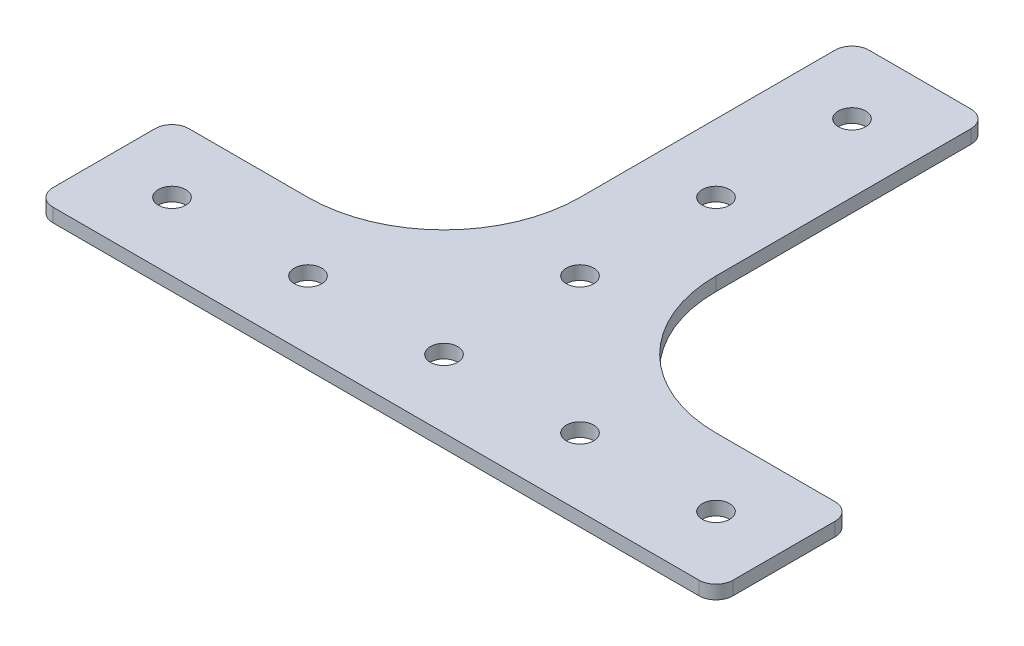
ISO-10303-21;
HEADER;
FILE_DESCRIPTION(('STEP AP214'),'2;1');
FILE_NAME('part.step','',(''),(''),'','','');
FILE_SCHEMA(('AUTOMOTIVE_DESIGN { 1 0 10303 214 1 1 1 1 }'));
ENDSEC;
DATA;
#1=APPLICATION_CONTEXT('core data for automotive mechanical design processes');
#2=APPLICATION_PROTOCOL_DEFINITION('international standard','automotive_design',2000,#1);
#3=PRODUCT_CONTEXT('',#1,'mechanical');
#4=PRODUCT('Part','Part','',(#3));
#5=PRODUCT_RELATED_PRODUCT_CATEGORY('part','',(#4));
#6=PRODUCT_DEFINITION_FORMATION('','',#4);
#7=PRODUCT_DEFINITION_CONTEXT('part definition',#1,'design');
#8=PRODUCT_DEFINITION('design','',#6,#7);
#9=PRODUCT_DEFINITION_SHAPE('','',#8);
#10=(LENGTH_UNIT() NAMED_UNIT(*) SI_UNIT(.MILLI.,.METRE.));
#11=(NAMED_UNIT(*) PLANE_ANGLE_UNIT() SI_UNIT($,.RADIAN.));
#12=(NAMED_UNIT(*) SI_UNIT($,.STERADIAN.) SOLID_ANGLE_UNIT());
#13=UNCERTAINTY_MEASURE_WITH_UNIT(LENGTH_MEASURE(1.E-05),#10,'distance_accuracy_value','');
#14=(GEOMETRIC_REPRESENTATION_CONTEXT(3) GLOBAL_UNCERTAINTY_ASSIGNED_CONTEXT((#13)) GLOBAL_UNIT_ASSIGNED_CONTEXT((#10,
#11,#12)) REPRESENTATION_CONTEXT('',''));
#15=CARTESIAN_POINT('',(0.,0.,0.));
#16=DIRECTION('',(0.,0.,1.));
#17=DIRECTION('',(1.,0.,0.));
#18=AXIS2_PLACEMENT_3D('',#15,#16,#17);
#19=CARTESIAN_POINT('',(-12.7,2.54,-25.4));
#20=DIRECTION('',(1.,0.,0.));
#21=DIRECTION('',(0.,0.,-1.));
#22=AXIS2_PLACEMENT_3D('',#19,#20,#21);
#23=PLANE('',#22);
#24=DIRECTION('',(0.,0.,1.));
#25=VECTOR('',#24,1.);
#26=CARTESIAN_POINT('',(-12.7,0.,-25.4));
#27=LINE('',#26,#25);
#28=CARTESIAN_POINT('',(-12.7,0.,-98.425));
#29=VERTEX_POINT('',#28);
#30=CARTESIAN_POINT('',(-12.7,0.,-50.8));
#31=VERTEX_POINT('',#30);
#32=EDGE_CURVE('E364',#29,#31,#27,.T.);
#33=ORIENTED_EDGE('',*,*,#32,.T.);
#34=DIRECTION('',(0.,-1.,0.));
#35=VECTOR('',#34,1.);
#36=CARTESIAN_POINT('',(-12.7,2.54,-50.8));
#37=LINE('',#36,#35);
#38=CARTESIAN_POINT('',(-12.7,2.54,-50.8));
#39=VERTEX_POINT('',#38);
#40=EDGE_CURVE('E274',#31,#39,#37,.F.);
#41=ORIENTED_EDGE('',*,*,#40,.T.);
#42=DIRECTION('',(0.,0.,1.));
#43=VECTOR('',#42,1.);
#44=CARTESIAN_POINT('',(-12.7,2.54,-25.4));
#45=LINE('',#44,#43);
#46=CARTESIAN_POINT('',(-12.7,2.54,-98.425));
#47=VERTEX_POINT('',#46);
#48=EDGE_CURVE('E197',#47,#39,#45,.T.);
#49=ORIENTED_EDGE('',*,*,#48,.F.);
#50=DIRECTION('',(0.,-1.,0.));
#51=VECTOR('',#50,1.);
#52=CARTESIAN_POINT('',(-12.7,2.54,-98.425));
#53=LINE('',#52,#51);
#54=EDGE_CURVE('E248',#47,#29,#53,.T.);
#55=ORIENTED_EDGE('',*,*,#54,.T.);
#56=EDGE_LOOP('',(#33,#41,#49,#55));
#57=FACE_BOUND('',#56,.T.);
#58=ADVANCED_FACE('F48',(#57),#23,.F.);
#59=CARTESIAN_POINT('',(-63.5,2.54,-25.4));
#60=DIRECTION('',(0.,0.,1.));
#61=DIRECTION('',(1.,0.,0.));
#62=AXIS2_PLACEMENT_3D('',#59,#60,#61);
#63=PLANE('',#62);
#64=DIRECTION('',(-1.,0.,0.));
#65=VECTOR('',#64,1.);
#66=CARTESIAN_POINT('',(-63.5,2.54,-25.4));
#67=LINE('',#66,#65);
#68=CARTESIAN_POINT('',(-38.1,2.54,-25.4));
#69=VERTEX_POINT('',#68);
#70=CARTESIAN_POINT('',(-60.325,2.54,-25.4));
#71=VERTEX_POINT('',#70);
#72=EDGE_CURVE('E347',#69,#71,#67,.T.);
#73=ORIENTED_EDGE('',*,*,#72,.F.);
#74=DIRECTION('',(0.,-1.,0.));
#75=VECTOR('',#74,1.);
#76=CARTESIAN_POINT('',(-38.1,0.,-25.4));
#77=LINE('',#76,#75);
#78=CARTESIAN_POINT('',(-38.1,0.,-25.4));
#79=VERTEX_POINT('',#78);
#80=EDGE_CURVE('E270',#69,#79,#77,.T.);
#81=ORIENTED_EDGE('',*,*,#80,.T.);
#82=DIRECTION('',(-1.,0.,0.));
#83=VECTOR('',#82,1.);
#84=CARTESIAN_POINT('',(-63.5,0.,-25.4));
#85=LINE('',#84,#83);
#86=CARTESIAN_POINT('',(-60.325,0.,-25.4));
#87=VERTEX_POINT('',#86);
#88=EDGE_CURVE('E368',#79,#87,#85,.T.);
#89=ORIENTED_EDGE('',*,*,#88,.T.);
#90=DIRECTION('',(0.,-1.,0.));
#91=VECTOR('',#90,1.);
#92=CARTESIAN_POINT('',(-60.325,2.54,-25.4));
#93=LINE('',#92,#91);
#94=EDGE_CURVE('E244',#87,#71,#93,.F.);
#95=ORIENTED_EDGE('',*,*,#94,.T.);
#96=EDGE_LOOP('',(#73,#81,#89,#95));
#97=FACE_BOUND('',#96,.T.);
#98=ADVANCED_FACE('F402',(#97),#63,.F.);
#99=CARTESIAN_POINT('',(-63.5,2.54,0.));
#100=DIRECTION('',(1.,0.,0.));
#101=DIRECTION('',(0.,0.,-1.));
#102=AXIS2_PLACEMENT_3D('',#99,#100,#101);
#103=PLANE('',#102);
#104=DIRECTION('',(0.,0.,1.));
#105=VECTOR('',#104,1.);
#106=CARTESIAN_POINT('',(-63.5,2.54,0.));
#107=LINE('',#106,#105);
#108=CARTESIAN_POINT('',(-63.5,2.54,-22.225));
#109=VERTEX_POINT('',#108);
#110=CARTESIAN_POINT('',(-63.5,2.54,-3.175));
#111=VERTEX_POINT('',#110);
#112=EDGE_CURVE('E342',#109,#111,#107,.T.);
#113=ORIENTED_EDGE('',*,*,#112,.F.);
#114=DIRECTION('',(0.,-1.,0.));
#115=VECTOR('',#114,1.);
#116=CARTESIAN_POINT('',(-63.5,2.54,-22.225));
#117=LINE('',#116,#115);
#118=CARTESIAN_POINT('',(-63.5,0.,-22.225));
#119=VERTEX_POINT('',#118);
#120=EDGE_CURVE('E240',#109,#119,#117,.T.);
#121=ORIENTED_EDGE('',*,*,#120,.T.);
#122=DIRECTION('',(0.,0.,1.));
#123=VECTOR('',#122,1.);
#124=CARTESIAN_POINT('',(-63.5,0.,0.));
#125=LINE('',#124,#123);
#126=CARTESIAN_POINT('',(-63.5,0.,-3.175));
#127=VERTEX_POINT('',#126);
#128=EDGE_CURVE('E371',#119,#127,#125,.T.);
#129=ORIENTED_EDGE('',*,*,#128,.T.);
#130=DIRECTION('',(0.,-1.,0.));
#131=VECTOR('',#130,1.);
#132=CARTESIAN_POINT('',(-63.5,2.54,-3.175));
#133=LINE('',#132,#131);
#134=EDGE_CURVE('E237',#127,#111,#133,.F.);
#135=ORIENTED_EDGE('',*,*,#134,.T.);
#136=EDGE_LOOP('',(#113,#121,#129,#135));
#137=FACE_BOUND('',#136,.T.);
#138=ADVANCED_FACE('F399',(#137),#103,.F.);
#139=CARTESIAN_POINT('',(-63.5,2.54,0.));
#140=DIRECTION('',(0.,0.,-1.));
#141=DIRECTION('',(-1.,0.,0.));
#142=AXIS2_PLACEMENT_3D('',#139,#140,#141);
#143=PLANE('',#142);
#144=DIRECTION('',(1.,0.,0.));
#145=VECTOR('',#144,1.);
#146=CARTESIAN_POINT('',(-63.5,0.,0.));
#147=LINE('',#146,#145);
#148=CARTESIAN_POINT('',(-60.325,0.,0.));
#149=VERTEX_POINT('',#148);
#150=CARTESIAN_POINT('',(60.325,0.,0.));
#151=VERTEX_POINT('',#150);
#152=EDGE_CURVE('E191',#149,#151,#147,.T.);
#153=ORIENTED_EDGE('',*,*,#152,.T.);
#154=DIRECTION('',(0.,-1.,0.));
#155=VECTOR('',#154,1.);
#156=CARTESIAN_POINT('',(60.325,2.54,0.));
#157=LINE('',#156,#155);
#158=CARTESIAN_POINT('',(60.325,2.54,0.));
#159=VERTEX_POINT('',#158);
#160=EDGE_CURVE('E267',#151,#159,#157,.F.);
#161=ORIENTED_EDGE('',*,*,#160,.T.);
#162=DIRECTION('',(1.,0.,0.));
#163=VECTOR('',#162,1.);
#164=CARTESIAN_POINT('',(-63.5,2.54,0.));
#165=LINE('',#164,#163);
#166=CARTESIAN_POINT('',(-60.325,2.54,0.));
#167=VERTEX_POINT('',#166);
#168=EDGE_CURVE('E337',#167,#159,#165,.T.);
#169=ORIENTED_EDGE('',*,*,#168,.F.);
#170=DIRECTION('',(0.,-1.,0.));
#171=VECTOR('',#170,1.);
#172=CARTESIAN_POINT('',(-60.325,2.54,0.));
#173=LINE('',#172,#171);
#174=EDGE_CURVE('E263',#167,#149,#173,.T.);
#175=ORIENTED_EDGE('',*,*,#174,.T.);
#176=EDGE_LOOP('',(#153,#161,#169,#175));
#177=FACE_BOUND('',#176,.T.);
#178=ADVANCED_FACE('F380',(#177),#143,.F.);
#179=CARTESIAN_POINT('',(63.5,2.54,-25.4));
#180=DIRECTION('',(-1.,0.,0.));
#181=DIRECTION('',(0.,0.,1.));
#182=AXIS2_PLACEMENT_3D('',#179,#180,#181);
#183=PLANE('',#182);
#184=DIRECTION('',(0.,0.,-1.));
#185=VECTOR('',#184,1.);
#186=CARTESIAN_POINT('',(63.5,0.,-25.4));
#187=LINE('',#186,#185);
#188=CARTESIAN_POINT('',(63.5,0.,-3.17500000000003));
#189=VERTEX_POINT('',#188);
#190=CARTESIAN_POINT('',(63.5,0.,-22.225));
#191=VERTEX_POINT('',#190);
#192=EDGE_CURVE('E184',#189,#191,#187,.T.);
#193=ORIENTED_EDGE('',*,*,#192,.T.);
#194=DIRECTION('',(0.,-1.,0.));
#195=VECTOR('',#194,1.);
#196=CARTESIAN_POINT('',(63.5,2.54,-22.225));
#197=LINE('',#196,#195);
#198=CARTESIAN_POINT('',(63.5,2.54,-22.225));
#199=VERTEX_POINT('',#198);
#200=EDGE_CURVE('E167',#191,#199,#197,.F.);
#201=ORIENTED_EDGE('',*,*,#200,.T.);
#202=DIRECTION('',(0.,0.,-1.));
#203=VECTOR('',#202,1.);
#204=CARTESIAN_POINT('',(63.5,2.54,-25.4));
#205=LINE('',#204,#203);
#206=CARTESIAN_POINT('',(63.5,2.54,-3.17500000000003));
#207=VERTEX_POINT('',#206);
#208=EDGE_CURVE('E332',#207,#199,#205,.T.);
#209=ORIENTED_EDGE('',*,*,#208,.F.);
#210=DIRECTION('',(0.,-1.,0.));
#211=VECTOR('',#210,1.);
#212=CARTESIAN_POINT('',(63.5,2.54,-3.17500000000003));
#213=LINE('',#212,#211);
#214=EDGE_CURVE('E171',#207,#189,#213,.T.);
#215=ORIENTED_EDGE('',*,*,#214,.T.);
#216=EDGE_LOOP('',(#193,#201,#209,#215));
#217=FACE_BOUND('',#216,.T.);
#218=ADVANCED_FACE('F390',(#217),#183,.F.);
#219=CARTESIAN_POINT('',(12.7,2.54,-25.4));
#220=DIRECTION('',(0.,0.,1.));
#221=DIRECTION('',(1.,0.,0.));
#222=AXIS2_PLACEMENT_3D('',#219,#220,#221);
#223=PLANE('',#222);
#224=DIRECTION('',(-1.,0.,0.));
#225=VECTOR('',#224,1.);
#226=CARTESIAN_POINT('',(12.7,0.,-25.4));
#227=LINE('',#226,#225);
#228=CARTESIAN_POINT('',(60.325,0.,-25.4));
#229=VERTEX_POINT('',#228);
#230=CARTESIAN_POINT('',(38.1,0.,-25.4));
#231=VERTEX_POINT('',#230);
#232=EDGE_CURVE('E175',#229,#231,#227,.T.);
#233=ORIENTED_EDGE('',*,*,#232,.T.);
#234=DIRECTION('',(0.,-1.,0.));
#235=VECTOR('',#234,1.);
#236=CARTESIAN_POINT('',(38.1,2.54,-25.4));
#237=LINE('',#236,#235);
#238=CARTESIAN_POINT('',(38.1,2.54,-25.4));
#239=VERTEX_POINT('',#238);
#240=EDGE_CURVE('E70',#231,#239,#237,.F.);
#241=ORIENTED_EDGE('',*,*,#240,.T.);
#242=DIRECTION('',(-1.,0.,0.));
#243=VECTOR('',#242,1.);
#244=CARTESIAN_POINT('',(12.7,2.54,-25.4));
#245=LINE('',#244,#243);
#246=CARTESIAN_POINT('',(60.325,2.54,-25.4));
#247=VERTEX_POINT('',#246);
#248=EDGE_CURVE('E176',#247,#239,#245,.T.);
#249=ORIENTED_EDGE('',*,*,#248,.F.);
#250=DIRECTION('',(0.,-1.,0.));
#251=VECTOR('',#250,1.);
#252=CARTESIAN_POINT('',(60.325,2.54,-25.4));
#253=LINE('',#252,#251);
#254=EDGE_CURVE('E166',#247,#229,#253,.T.);
#255=ORIENTED_EDGE('',*,*,#254,.T.);
#256=EDGE_LOOP('',(#233,#241,#249,#255));
#257=FACE_BOUND('',#256,.T.);
#258=ADVANCED_FACE('F174',(#257),#223,.F.);
#259=CARTESIAN_POINT('',(12.7,2.54,-101.6));
#260=DIRECTION('',(-1.,0.,0.));
#261=DIRECTION('',(0.,0.,1.));
#262=AXIS2_PLACEMENT_3D('',#259,#260,#261);
#263=PLANE('',#262);
#264=DIRECTION('',(0.,0.,-1.));
#265=VECTOR('',#264,1.);
#266=CARTESIAN_POINT('',(12.7,2.54,-101.6));
#267=LINE('',#266,#265);
#268=CARTESIAN_POINT('',(12.7,2.54,-50.8));
#269=VERTEX_POINT('',#268);
#270=CARTESIAN_POINT('',(12.7,2.54,-98.425));
#271=VERTEX_POINT('',#270);
#272=EDGE_CURVE('E325',#269,#271,#267,.T.);
#273=ORIENTED_EDGE('',*,*,#272,.F.);
#274=DIRECTION('',(0.,-1.,0.));
#275=VECTOR('',#274,1.);
#276=CARTESIAN_POINT('',(12.7,0.,-50.8));
#277=LINE('',#276,#275);
#278=CARTESIAN_POINT('',(12.7,0.,-50.8));
#279=VERTEX_POINT('',#278);
#280=EDGE_CURVE('E277',#269,#279,#277,.T.);
#281=ORIENTED_EDGE('',*,*,#280,.T.);
#282=DIRECTION('',(0.,0.,-1.));
#283=VECTOR('',#282,1.);
#284=CARTESIAN_POINT('',(12.7,0.,-101.6));
#285=LINE('',#284,#283);
#286=CARTESIAN_POINT('',(12.7,0.,-98.425));
#287=VERTEX_POINT('',#286);
#288=EDGE_CURVE('E183',#279,#287,#285,.T.);
#289=ORIENTED_EDGE('',*,*,#288,.T.);
#290=DIRECTION('',(0.,-1.,0.));
#291=VECTOR('',#290,1.);
#292=CARTESIAN_POINT('',(12.7,2.54,-98.425));
#293=LINE('',#292,#291);
#294=EDGE_CURVE('E259',#287,#271,#293,.F.);
#295=ORIENTED_EDGE('',*,*,#294,.T.);
#296=EDGE_LOOP('',(#273,#281,#289,#295));
#297=FACE_BOUND('',#296,.T.);
#298=ADVANCED_FACE('F397',(#297),#263,.F.);
#299=CARTESIAN_POINT('',(-12.7,2.54,-101.6));
#300=DIRECTION('',(0.,0.,1.));
#301=DIRECTION('',(1.,0.,0.));
#302=AXIS2_PLACEMENT_3D('',#299,#300,#301);
#303=PLANE('',#302);
#304=DIRECTION('',(-1.,0.,0.));
#305=VECTOR('',#304,1.);
#306=CARTESIAN_POINT('',(-12.7,0.,-101.6));
#307=LINE('',#306,#305);
#308=CARTESIAN_POINT('',(9.52499999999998,0.,-101.6));
#309=VERTEX_POINT('',#308);
#310=CARTESIAN_POINT('',(-9.52500000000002,0.,-101.6));
#311=VERTEX_POINT('',#310);
#312=EDGE_CURVE('E189',#309,#311,#307,.T.);
#313=ORIENTED_EDGE('',*,*,#312,.T.);
#314=DIRECTION('',(0.,-1.,0.));
#315=VECTOR('',#314,1.);
#316=CARTESIAN_POINT('',(-9.52500000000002,2.54,-101.6));
#317=LINE('',#316,#315);
#318=CARTESIAN_POINT('',(-9.52500000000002,2.54,-101.6));
#319=VERTEX_POINT('',#318);
#320=EDGE_CURVE('E256',#311,#319,#317,.F.);
#321=ORIENTED_EDGE('',*,*,#320,.T.);
#322=DIRECTION('',(-1.,0.,0.));
#323=VECTOR('',#322,1.);
#324=CARTESIAN_POINT('',(-12.7,2.54,-101.6));
#325=LINE('',#324,#323);
#326=CARTESIAN_POINT('',(9.52499999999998,2.54,-101.6));
#327=VERTEX_POINT('',#326);
#328=EDGE_CURVE('E179',#327,#319,#325,.T.);
#329=ORIENTED_EDGE('',*,*,#328,.F.);
#330=DIRECTION('',(0.,-1.,0.));
#331=VECTOR('',#330,1.);
#332=CARTESIAN_POINT('',(9.52499999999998,2.54,-101.6));
#333=LINE('',#332,#331);
#334=EDGE_CURVE('E252',#327,#309,#333,.T.);
#335=ORIENTED_EDGE('',*,*,#334,.T.);
#336=EDGE_LOOP('',(#313,#321,#329,#335));
#337=FACE_BOUND('',#336,.T.);
#338=ADVANCED_FACE('F462',(#337),#303,.F.);
#339=CARTESIAN_POINT('',(0.,2.54,0.));
#340=DIRECTION('',(0.,-1.,0.));
#341=DIRECTION('',(0.,0.,-1.));
#342=AXIS2_PLACEMENT_3D('',#339,#340,#341);
#343=PLANE('',#342);
#344=CARTESIAN_POINT('',(0.,2.54,-12.7));
#345=DIRECTION('',(0.,1.,0.));
#346=DIRECTION('',(0.,0.,1.));
#347=AXIS2_PLACEMENT_3D('',#344,#345,#346);
#348=CIRCLE('',#347,2.55269999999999);
#349=CARTESIAN_POINT('',(0.,2.54,-10.1473));
#350=VERTEX_POINT('',#349);
#351=EDGE_CURVE('E528',#350,#350,#348,.T.);
#352=ORIENTED_EDGE('',*,*,#351,.F.);
#353=EDGE_LOOP('',(#352));
#354=FACE_BOUND('',#353,.T.);
#355=CARTESIAN_POINT('',(25.4,2.54,-12.7));
#356=DIRECTION('',(0.,1.,0.));
#357=DIRECTION('',(0.,0.,1.));
#358=AXIS2_PLACEMENT_3D('',#355,#356,#357);
#359=CIRCLE('',#358,2.55269999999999);
#360=CARTESIAN_POINT('',(25.4,2.54,-10.1473));
#361=VERTEX_POINT('',#360);
#362=EDGE_CURVE('E517',#361,#361,#359,.T.);
#363=ORIENTED_EDGE('',*,*,#362,.F.);
#364=EDGE_LOOP('',(#363));
#365=FACE_BOUND('',#364,.T.);
#366=CARTESIAN_POINT('',(50.8,2.54,-12.7));
#367=DIRECTION('',(0.,1.,0.));
#368=DIRECTION('',(0.,0.,1.));
#369=AXIS2_PLACEMENT_3D('',#366,#367,#368);
#370=CIRCLE('',#369,2.55269999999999);
#371=CARTESIAN_POINT('',(50.8,2.54,-10.1473));
#372=VERTEX_POINT('',#371);
#373=EDGE_CURVE('E525',#372,#372,#370,.T.);
#374=ORIENTED_EDGE('',*,*,#373,.F.);
#375=EDGE_LOOP('',(#374));
#376=FACE_BOUND('',#375,.T.);
#377=CARTESIAN_POINT('',(-25.4,2.54,-12.7));
#378=DIRECTION('',(0.,1.,0.));
#379=DIRECTION('',(0.,0.,1.));
#380=AXIS2_PLACEMENT_3D('',#377,#378,#379);
#381=CIRCLE('',#380,2.55269999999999);
#382=CARTESIAN_POINT('',(-25.4,2.54,-10.1473));
#383=VERTEX_POINT('',#382);
#384=EDGE_CURVE('E539',#383,#383,#381,.T.);
#385=ORIENTED_EDGE('',*,*,#384,.F.);
#386=EDGE_LOOP('',(#385));
#387=FACE_BOUND('',#386,.T.);
#388=CARTESIAN_POINT('',(-50.8,2.54,-12.7));
#389=DIRECTION('',(0.,1.,0.));
#390=DIRECTION('',(0.,0.,1.));
#391=AXIS2_PLACEMENT_3D('',#388,#389,#390);
#392=CIRCLE('',#391,2.55269999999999);
#393=CARTESIAN_POINT('',(-50.8,2.54,-10.1473));
#394=VERTEX_POINT('',#393);
#395=EDGE_CURVE('E547',#394,#394,#392,.T.);
#396=ORIENTED_EDGE('',*,*,#395,.F.);
#397=EDGE_LOOP('',(#396));
#398=FACE_BOUND('',#397,.T.);
#399=CARTESIAN_POINT('',(0.,2.54,-38.1));
#400=DIRECTION('',(0.,1.,0.));
#401=DIRECTION('',(0.,0.,1.));
#402=AXIS2_PLACEMENT_3D('',#399,#400,#401);
#403=CIRCLE('',#402,2.55269999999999);
#404=CARTESIAN_POINT('',(0.,2.54,-35.5473));
#405=VERTEX_POINT('',#404);
#406=EDGE_CURVE('E555',#405,#405,#403,.T.);
#407=ORIENTED_EDGE('',*,*,#406,.F.);
#408=EDGE_LOOP('',(#407));
#409=FACE_BOUND('',#408,.T.);
#410=CARTESIAN_POINT('',(0.,2.54,-63.5));
#411=DIRECTION('',(0.,1.,0.));
#412=DIRECTION('',(0.,0.,1.));
#413=AXIS2_PLACEMENT_3D('',#410,#411,#412);
#414=CIRCLE('',#413,2.55269999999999);
#415=CARTESIAN_POINT('',(0.,2.54,-60.9473));
#416=VERTEX_POINT('',#415);
#417=EDGE_CURVE('E563',#416,#416,#414,.T.);
#418=ORIENTED_EDGE('',*,*,#417,.F.);
#419=EDGE_LOOP('',(#418));
#420=FACE_BOUND('',#419,.T.);
#421=CARTESIAN_POINT('',(0.,2.54,-88.9));
#422=DIRECTION('',(0.,1.,0.));
#423=DIRECTION('',(0.,0.,1.));
#424=AXIS2_PLACEMENT_3D('',#421,#422,#423);
#425=CIRCLE('',#424,2.55269999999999);
#426=CARTESIAN_POINT('',(0.,2.54,-86.3473));
#427=VERTEX_POINT('',#426);
#428=EDGE_CURVE('E570',#427,#427,#425,.T.);
#429=ORIENTED_EDGE('',*,*,#428,.F.);
#430=EDGE_LOOP('',(#429));
#431=FACE_BOUND('',#430,.T.);
#432=ORIENTED_EDGE('',*,*,#208,.T.);
#433=CARTESIAN_POINT('',(60.325,2.54,-22.225));
#434=DIRECTION('',(0.,-1.,0.));
#435=DIRECTION('',(0.,0.,-1.));
#436=AXIS2_PLACEMENT_3D('',#433,#434,#435);
#437=CIRCLE('',#436,3.175);
#438=EDGE_CURVE('E234',#199,#247,#437,.F.);
#439=ORIENTED_EDGE('',*,*,#438,.T.);
#440=ORIENTED_EDGE('',*,*,#248,.T.);
#441=CARTESIAN_POINT('',(38.1,2.54,-50.8));
#442=DIRECTION('',(0.,-1.,0.));
#443=DIRECTION('',(0.,0.,-1.));
#444=AXIS2_PLACEMENT_3D('',#441,#442,#443);
#445=CIRCLE('',#444,25.4);
#446=EDGE_CURVE('E13',#239,#269,#445,.T.);
#447=ORIENTED_EDGE('',*,*,#446,.T.);
#448=ORIENTED_EDGE('',*,*,#272,.T.);
#449=CARTESIAN_POINT('',(9.52499999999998,2.54,-98.425));
#450=DIRECTION('',(0.,-1.,0.));
#451=DIRECTION('',(0.,0.,-1.));
#452=AXIS2_PLACEMENT_3D('',#449,#450,#451);
#453=CIRCLE('',#452,3.175);
#454=EDGE_CURVE('E225',#271,#327,#453,.F.);
#455=ORIENTED_EDGE('',*,*,#454,.T.);
#456=ORIENTED_EDGE('',*,*,#328,.T.);
#457=CARTESIAN_POINT('',(-9.52500000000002,2.54,-98.425));
#458=DIRECTION('',(0.,-1.,0.));
#459=DIRECTION('',(0.,0.,-1.));
#460=AXIS2_PLACEMENT_3D('',#457,#458,#459);
#461=CIRCLE('',#460,3.175);
#462=EDGE_CURVE('E228',#319,#47,#461,.F.);
#463=ORIENTED_EDGE('',*,*,#462,.T.);
#464=ORIENTED_EDGE('',*,*,#48,.T.);
#465=CARTESIAN_POINT('',(-38.1,2.54,-50.8));
#466=DIRECTION('',(0.,-1.,0.));
#467=DIRECTION('',(0.,0.,-1.));
#468=AXIS2_PLACEMENT_3D('',#465,#466,#467);
#469=CIRCLE('',#468,25.4);
#470=EDGE_CURVE('E286',#39,#69,#469,.T.);
#471=ORIENTED_EDGE('',*,*,#470,.T.);
#472=ORIENTED_EDGE('',*,*,#72,.T.);
#473=CARTESIAN_POINT('',(-60.325,2.54,-22.225));
#474=DIRECTION('',(0.,-1.,0.));
#475=DIRECTION('',(0.,0.,-1.));
#476=AXIS2_PLACEMENT_3D('',#473,#474,#475);
#477=CIRCLE('',#476,3.175);
#478=EDGE_CURVE('E231',#71,#109,#477,.F.);
#479=ORIENTED_EDGE('',*,*,#478,.T.);
#480=ORIENTED_EDGE('',*,*,#112,.T.);
#481=CARTESIAN_POINT('',(-60.325,2.54,-3.175));
#482=DIRECTION('',(0.,-1.,0.));
#483=DIRECTION('',(0.,0.,-1.));
#484=AXIS2_PLACEMENT_3D('',#481,#482,#483);
#485=CIRCLE('',#484,3.175);
#486=EDGE_CURVE('E219',#111,#167,#485,.F.);
#487=ORIENTED_EDGE('',*,*,#486,.T.);
#488=ORIENTED_EDGE('',*,*,#168,.T.);
#489=CARTESIAN_POINT('',(60.325,2.54,-3.17500000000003));
#490=DIRECTION('',(0.,-1.,0.));
#491=DIRECTION('',(0.,0.,-1.));
#492=AXIS2_PLACEMENT_3D('',#489,#490,#491);
#493=CIRCLE('',#492,3.175);
#494=EDGE_CURVE('E222',#159,#207,#493,.F.);
#495=ORIENTED_EDGE('',*,*,#494,.T.);
#496=EDGE_LOOP('',(#432,#439,#440,#447,#448,#455,#456,#463,#464,#471,#472,#479,#480,#487,#488,#495));
#497=FACE_BOUND('',#496,.T.);
#498=ADVANCED_FACE('F388',(#354,#365,#376,#387,#398,#409,#420,#431,#497),#343,.F.);
#499=CARTESIAN_POINT('',(0.,0.,0.));
#500=DIRECTION('',(0.,-1.,0.));
#501=DIRECTION('',(0.,0.,-1.));
#502=AXIS2_PLACEMENT_3D('',#499,#500,#501);
#503=PLANE('',#502);
#504=CARTESIAN_POINT('',(0.,0.,-12.7));
#505=DIRECTION('',(0.,1.,0.));
#506=DIRECTION('',(0.,0.,1.));
#507=AXIS2_PLACEMENT_3D('',#504,#505,#506);
#508=CIRCLE('',#507,2.5527);
#509=CARTESIAN_POINT('',(0.,0.,-10.1473));
#510=VERTEX_POINT('',#509);
#511=EDGE_CURVE('E520',#510,#510,#508,.T.);
#512=ORIENTED_EDGE('',*,*,#511,.T.);
#513=EDGE_LOOP('',(#512));
#514=FACE_BOUND('',#513,.T.);
#515=CARTESIAN_POINT('',(25.4,0.,-12.7));
#516=DIRECTION('',(0.,1.,0.));
#517=DIRECTION('',(0.,0.,1.));
#518=AXIS2_PLACEMENT_3D('',#515,#516,#517);
#519=CIRCLE('',#518,2.5527);
#520=CARTESIAN_POINT('',(25.4,0.,-10.1473));
#521=VERTEX_POINT('',#520);
#522=EDGE_CURVE('E514',#521,#521,#519,.T.);
#523=ORIENTED_EDGE('',*,*,#522,.T.);
#524=EDGE_LOOP('',(#523));
#525=FACE_BOUND('',#524,.T.);
#526=CARTESIAN_POINT('',(50.8,0.,-12.7));
#527=DIRECTION('',(0.,1.,0.));
#528=DIRECTION('',(0.,0.,1.));
#529=AXIS2_PLACEMENT_3D('',#526,#527,#528);
#530=CIRCLE('',#529,2.5527);
#531=CARTESIAN_POINT('',(50.8,0.,-10.1473));
#532=VERTEX_POINT('',#531);
#533=EDGE_CURVE('E535',#532,#532,#530,.T.);
#534=ORIENTED_EDGE('',*,*,#533,.T.);
#535=EDGE_LOOP('',(#534));
#536=FACE_BOUND('',#535,.T.);
#537=CARTESIAN_POINT('',(-25.4,0.,-12.7));
#538=DIRECTION('',(0.,1.,0.));
#539=DIRECTION('',(0.,0.,1.));
#540=AXIS2_PLACEMENT_3D('',#537,#538,#539);
#541=CIRCLE('',#540,2.5527);
#542=CARTESIAN_POINT('',(-25.4,0.,-10.1473));
#543=VERTEX_POINT('',#542);
#544=EDGE_CURVE('E543',#543,#543,#541,.T.);
#545=ORIENTED_EDGE('',*,*,#544,.T.);
#546=EDGE_LOOP('',(#545));
#547=FACE_BOUND('',#546,.T.);
#548=CARTESIAN_POINT('',(-50.8,0.,-12.7));
#549=DIRECTION('',(0.,1.,0.));
#550=DIRECTION('',(0.,0.,1.));
#551=AXIS2_PLACEMENT_3D('',#548,#549,#550);
#552=CIRCLE('',#551,2.5527);
#553=CARTESIAN_POINT('',(-50.8,0.,-10.1473));
#554=VERTEX_POINT('',#553);
#555=EDGE_CURVE('E551',#554,#554,#552,.T.);
#556=ORIENTED_EDGE('',*,*,#555,.T.);
#557=EDGE_LOOP('',(#556));
#558=FACE_BOUND('',#557,.T.);
#559=CARTESIAN_POINT('',(0.,0.,-38.1));
#560=DIRECTION('',(0.,1.,0.));
#561=DIRECTION('',(0.,0.,1.));
#562=AXIS2_PLACEMENT_3D('',#559,#560,#561);
#563=CIRCLE('',#562,2.5527);
#564=CARTESIAN_POINT('',(0.,0.,-35.5473));
#565=VERTEX_POINT('',#564);
#566=EDGE_CURVE('E559',#565,#565,#563,.T.);
#567=ORIENTED_EDGE('',*,*,#566,.T.);
#568=EDGE_LOOP('',(#567));
#569=FACE_BOUND('',#568,.T.);
#570=CARTESIAN_POINT('',(0.,0.,-63.5));
#571=DIRECTION('',(0.,1.,0.));
#572=DIRECTION('',(0.,0.,1.));
#573=AXIS2_PLACEMENT_3D('',#570,#571,#572);
#574=CIRCLE('',#573,2.5527);
#575=CARTESIAN_POINT('',(0.,0.,-60.9473));
#576=VERTEX_POINT('',#575);
#577=EDGE_CURVE('E567',#576,#576,#574,.T.);
#578=ORIENTED_EDGE('',*,*,#577,.T.);
#579=EDGE_LOOP('',(#578));
#580=FACE_BOUND('',#579,.T.);
#581=CARTESIAN_POINT('',(0.,0.,-88.9));
#582=DIRECTION('',(0.,1.,0.));
#583=DIRECTION('',(0.,0.,1.));
#584=AXIS2_PLACEMENT_3D('',#581,#582,#583);
#585=CIRCLE('',#584,2.5527);
#586=CARTESIAN_POINT('',(0.,0.,-86.3473));
#587=VERTEX_POINT('',#586);
#588=EDGE_CURVE('E361',#587,#587,#585,.T.);
#589=ORIENTED_EDGE('',*,*,#588,.T.);
#590=EDGE_LOOP('',(#589));
#591=FACE_BOUND('',#590,.T.);
#592=ORIENTED_EDGE('',*,*,#232,.F.);
#593=CARTESIAN_POINT('',(60.325,0.,-22.225));
#594=DIRECTION('',(0.,-1.,0.));
#595=DIRECTION('',(0.,0.,-1.));
#596=AXIS2_PLACEMENT_3D('',#593,#594,#595);
#597=CIRCLE('',#596,3.175);
#598=EDGE_CURVE('E162',#229,#191,#597,.T.);
#599=ORIENTED_EDGE('',*,*,#598,.T.);
#600=ORIENTED_EDGE('',*,*,#192,.F.);
#601=CARTESIAN_POINT('',(60.325,0.,-3.17500000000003));
#602=DIRECTION('',(0.,-1.,0.));
#603=DIRECTION('',(0.,0.,-1.));
#604=AXIS2_PLACEMENT_3D('',#601,#602,#603);
#605=CIRCLE('',#604,3.175);
#606=EDGE_CURVE('E201',#189,#151,#605,.T.);
#607=ORIENTED_EDGE('',*,*,#606,.T.);
#608=ORIENTED_EDGE('',*,*,#152,.F.);
#609=CARTESIAN_POINT('',(-60.325,0.,-3.175));
#610=DIRECTION('',(0.,-1.,0.));
#611=DIRECTION('',(0.,0.,-1.));
#612=AXIS2_PLACEMENT_3D('',#609,#610,#611);
#613=CIRCLE('',#612,3.175);
#614=EDGE_CURVE('E178',#149,#127,#613,.T.);
#615=ORIENTED_EDGE('',*,*,#614,.T.);
#616=ORIENTED_EDGE('',*,*,#128,.F.);
#617=CARTESIAN_POINT('',(-60.325,0.,-22.225));
#618=DIRECTION('',(0.,-1.,0.));
#619=DIRECTION('',(0.,0.,-1.));
#620=AXIS2_PLACEMENT_3D('',#617,#618,#619);
#621=CIRCLE('',#620,3.175);
#622=EDGE_CURVE('E172',#119,#87,#621,.T.);
#623=ORIENTED_EDGE('',*,*,#622,.T.);
#624=ORIENTED_EDGE('',*,*,#88,.F.);
#625=CARTESIAN_POINT('',(-38.1,0.,-50.8));
#626=DIRECTION('',(0.,-1.,0.));
#627=DIRECTION('',(0.,0.,-1.));
#628=AXIS2_PLACEMENT_3D('',#625,#626,#627);
#629=CIRCLE('',#628,25.4);
#630=EDGE_CURVE('E283',#79,#31,#629,.F.);
#631=ORIENTED_EDGE('',*,*,#630,.T.);
#632=ORIENTED_EDGE('',*,*,#32,.F.);
#633=CARTESIAN_POINT('',(-9.52500000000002,0.,-98.425));
#634=DIRECTION('',(0.,-1.,0.));
#635=DIRECTION('',(0.,0.,-1.));
#636=AXIS2_PLACEMENT_3D('',#633,#634,#635);
#637=CIRCLE('',#636,3.175);
#638=EDGE_CURVE('E208',#29,#311,#637,.T.);
#639=ORIENTED_EDGE('',*,*,#638,.T.);
#640=ORIENTED_EDGE('',*,*,#312,.F.);
#641=CARTESIAN_POINT('',(9.52499999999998,0.,-98.425));
#642=DIRECTION('',(0.,-1.,0.));
#643=DIRECTION('',(0.,0.,-1.));
#644=AXIS2_PLACEMENT_3D('',#641,#642,#643);
#645=CIRCLE('',#644,3.175);
#646=EDGE_CURVE('E204',#309,#287,#645,.T.);
#647=ORIENTED_EDGE('',*,*,#646,.T.);
#648=ORIENTED_EDGE('',*,*,#288,.F.);
#649=CARTESIAN_POINT('',(38.1,0.,-50.8));
#650=DIRECTION('',(0.,-1.,0.));
#651=DIRECTION('',(0.,0.,-1.));
#652=AXIS2_PLACEMENT_3D('',#649,#650,#651);
#653=CIRCLE('',#652,25.4);
#654=EDGE_CURVE('E57',#279,#231,#653,.F.);
#655=ORIENTED_EDGE('',*,*,#654,.T.);
#656=EDGE_LOOP('',(#592,#599,#600,#607,#608,#615,#616,#623,#624,#631,#632,#639,#640,#647,#648,#655));
#657=FACE_BOUND('',#656,.T.);
#658=ADVANCED_FACE('F181',(#514,#525,#536,#547,#558,#569,#580,#591,#657),#503,.T.);
#659=CARTESIAN_POINT('',(60.325,2.54,-22.225));
#660=DIRECTION('',(0.,-1.,0.));
#661=DIRECTION('',(0.,0.,-1.));
#662=AXIS2_PLACEMENT_3D('',#659,#660,#661);
#663=CYLINDRICAL_SURFACE('',#662,3.175);
#664=ORIENTED_EDGE('',*,*,#438,.F.);
#665=ORIENTED_EDGE('',*,*,#200,.F.);
#666=ORIENTED_EDGE('',*,*,#598,.F.);
#667=ORIENTED_EDGE('',*,*,#254,.F.);
#668=EDGE_LOOP('',(#664,#665,#666,#667));
#669=FACE_BOUND('',#668,.T.);
#670=ADVANCED_FACE('F165',(#669),#663,.T.);
#671=CARTESIAN_POINT('',(-60.325,2.54,-22.225));
#672=DIRECTION('',(0.,-1.,0.));
#673=DIRECTION('',(0.,0.,-1.));
#674=AXIS2_PLACEMENT_3D('',#671,#672,#673);
#675=CYLINDRICAL_SURFACE('',#674,3.175);
#676=ORIENTED_EDGE('',*,*,#478,.F.);
#677=ORIENTED_EDGE('',*,*,#94,.F.);
#678=ORIENTED_EDGE('',*,*,#622,.F.);
#679=ORIENTED_EDGE('',*,*,#120,.F.);
#680=EDGE_LOOP('',(#676,#677,#678,#679));
#681=FACE_BOUND('',#680,.T.);
#682=ADVANCED_FACE('F414',(#681),#675,.T.);
#683=CARTESIAN_POINT('',(-9.52500000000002,2.54,-98.425));
#684=DIRECTION('',(0.,-1.,0.));
#685=DIRECTION('',(0.,0.,-1.));
#686=AXIS2_PLACEMENT_3D('',#683,#684,#685);
#687=CYLINDRICAL_SURFACE('',#686,3.175);
#688=ORIENTED_EDGE('',*,*,#462,.F.);
#689=ORIENTED_EDGE('',*,*,#320,.F.);
#690=ORIENTED_EDGE('',*,*,#638,.F.);
#691=ORIENTED_EDGE('',*,*,#54,.F.);
#692=EDGE_LOOP('',(#688,#689,#690,#691));
#693=FACE_BOUND('',#692,.T.);
#694=ADVANCED_FACE('F417',(#693),#687,.T.);
#695=CARTESIAN_POINT('',(9.52499999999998,2.54,-98.425));
#696=DIRECTION('',(0.,-1.,0.));
#697=DIRECTION('',(0.,0.,-1.));
#698=AXIS2_PLACEMENT_3D('',#695,#696,#697);
#699=CYLINDRICAL_SURFACE('',#698,3.175);
#700=ORIENTED_EDGE('',*,*,#454,.F.);
#701=ORIENTED_EDGE('',*,*,#294,.F.);
#702=ORIENTED_EDGE('',*,*,#646,.F.);
#703=ORIENTED_EDGE('',*,*,#334,.F.);
#704=EDGE_LOOP('',(#700,#701,#702,#703));
#705=FACE_BOUND('',#704,.T.);
#706=ADVANCED_FACE('F421',(#705),#699,.T.);
#707=CARTESIAN_POINT('',(60.325,2.54,-3.17500000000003));
#708=DIRECTION('',(0.,-1.,0.));
#709=DIRECTION('',(0.,0.,-1.));
#710=AXIS2_PLACEMENT_3D('',#707,#708,#709);
#711=CYLINDRICAL_SURFACE('',#710,3.175);
#712=ORIENTED_EDGE('',*,*,#494,.F.);
#713=ORIENTED_EDGE('',*,*,#160,.F.);
#714=ORIENTED_EDGE('',*,*,#606,.F.);
#715=ORIENTED_EDGE('',*,*,#214,.F.);
#716=EDGE_LOOP('',(#712,#713,#714,#715));
#717=FACE_BOUND('',#716,.T.);
#718=ADVANCED_FACE('F385',(#717),#711,.T.);
#719=CARTESIAN_POINT('',(-60.325,2.54,-3.175));
#720=DIRECTION('',(0.,-1.,0.));
#721=DIRECTION('',(0.,0.,-1.));
#722=AXIS2_PLACEMENT_3D('',#719,#720,#721);
#723=CYLINDRICAL_SURFACE('',#722,3.175);
#724=ORIENTED_EDGE('',*,*,#486,.F.);
#725=ORIENTED_EDGE('',*,*,#134,.F.);
#726=ORIENTED_EDGE('',*,*,#614,.F.);
#727=ORIENTED_EDGE('',*,*,#174,.F.);
#728=EDGE_LOOP('',(#724,#725,#726,#727));
#729=FACE_BOUND('',#728,.T.);
#730=ADVANCED_FACE('F428',(#729),#723,.T.);
#731=CARTESIAN_POINT('',(0.,2.54,-88.9));
#732=DIRECTION('',(0.,1.,0.));
#733=DIRECTION('',(0.,0.,1.));
#734=AXIS2_PLACEMENT_3D('',#731,#732,#733);
#735=CYLINDRICAL_SURFACE('',#734,2.55269999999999);
#736=ORIENTED_EDGE('',*,*,#588,.F.);
#737=EDGE_LOOP('',(#736));
#738=FACE_BOUND('',#737,.T.);
#739=ORIENTED_EDGE('',*,*,#428,.T.);
#740=EDGE_LOOP('',(#739));
#741=FACE_BOUND('',#740,.T.);
#742=ADVANCED_FACE('F430',(#738,#741),#735,.F.);
#743=CARTESIAN_POINT('',(0.,2.54,-63.5));
#744=DIRECTION('',(0.,1.,0.));
#745=DIRECTION('',(0.,0.,1.));
#746=AXIS2_PLACEMENT_3D('',#743,#744,#745);
#747=CYLINDRICAL_SURFACE('',#746,2.55269999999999);
#748=ORIENTED_EDGE('',*,*,#577,.F.);
#749=EDGE_LOOP('',(#748));
#750=FACE_BOUND('',#749,.T.);
#751=ORIENTED_EDGE('',*,*,#417,.T.);
#752=EDGE_LOOP('',(#751));
#753=FACE_BOUND('',#752,.T.);
#754=ADVANCED_FACE('F486',(#750,#753),#747,.F.);
#755=CARTESIAN_POINT('',(0.,2.54,-38.1));
#756=DIRECTION('',(0.,1.,0.));
#757=DIRECTION('',(0.,0.,1.));
#758=AXIS2_PLACEMENT_3D('',#755,#756,#757);
#759=CYLINDRICAL_SURFACE('',#758,2.55269999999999);
#760=ORIENTED_EDGE('',*,*,#566,.F.);
#761=EDGE_LOOP('',(#760));
#762=FACE_BOUND('',#761,.T.);
#763=ORIENTED_EDGE('',*,*,#406,.T.);
#764=EDGE_LOOP('',(#763));
#765=FACE_BOUND('',#764,.T.);
#766=ADVANCED_FACE('F490',(#762,#765),#759,.F.);
#767=CARTESIAN_POINT('',(-50.8,2.54,-12.7));
#768=DIRECTION('',(0.,1.,0.));
#769=DIRECTION('',(0.,0.,1.));
#770=AXIS2_PLACEMENT_3D('',#767,#768,#769);
#771=CYLINDRICAL_SURFACE('',#770,2.55269999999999);
#772=ORIENTED_EDGE('',*,*,#555,.F.);
#773=EDGE_LOOP('',(#772));
#774=FACE_BOUND('',#773,.T.);
#775=ORIENTED_EDGE('',*,*,#395,.T.);
#776=EDGE_LOOP('',(#775));
#777=FACE_BOUND('',#776,.T.);
#778=ADVANCED_FACE('F494',(#774,#777),#771,.F.);
#779=CARTESIAN_POINT('',(-25.4,2.54,-12.7));
#780=DIRECTION('',(0.,1.,0.));
#781=DIRECTION('',(0.,0.,1.));
#782=AXIS2_PLACEMENT_3D('',#779,#780,#781);
#783=CYLINDRICAL_SURFACE('',#782,2.55269999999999);
#784=ORIENTED_EDGE('',*,*,#544,.F.);
#785=EDGE_LOOP('',(#784));
#786=FACE_BOUND('',#785,.T.);
#787=ORIENTED_EDGE('',*,*,#384,.T.);
#788=EDGE_LOOP('',(#787));
#789=FACE_BOUND('',#788,.T.);
#790=ADVANCED_FACE('F498',(#786,#789),#783,.F.);
#791=CARTESIAN_POINT('',(50.8,2.54,-12.7));
#792=DIRECTION('',(0.,1.,0.));
#793=DIRECTION('',(0.,0.,1.));
#794=AXIS2_PLACEMENT_3D('',#791,#792,#793);
#795=CYLINDRICAL_SURFACE('',#794,2.55269999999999);
#796=ORIENTED_EDGE('',*,*,#533,.F.);
#797=EDGE_LOOP('',(#796));
#798=FACE_BOUND('',#797,.T.);
#799=ORIENTED_EDGE('',*,*,#373,.T.);
#800=EDGE_LOOP('',(#799));
#801=FACE_BOUND('',#800,.T.);
#802=ADVANCED_FACE('F502',(#798,#801),#795,.F.);
#803=CARTESIAN_POINT('',(25.4,2.54,-12.7));
#804=DIRECTION('',(0.,1.,0.));
#805=DIRECTION('',(0.,0.,1.));
#806=AXIS2_PLACEMENT_3D('',#803,#804,#805);
#807=CYLINDRICAL_SURFACE('',#806,2.55269999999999);
#808=ORIENTED_EDGE('',*,*,#522,.F.);
#809=EDGE_LOOP('',(#808));
#810=FACE_BOUND('',#809,.T.);
#811=ORIENTED_EDGE('',*,*,#362,.T.);
#812=EDGE_LOOP('',(#811));
#813=FACE_BOUND('',#812,.T.);
#814=ADVANCED_FACE('F441',(#810,#813),#807,.F.);
#815=CARTESIAN_POINT('',(0.,2.54,-12.7));
#816=DIRECTION('',(0.,1.,0.));
#817=DIRECTION('',(0.,0.,1.));
#818=AXIS2_PLACEMENT_3D('',#815,#816,#817);
#819=CYLINDRICAL_SURFACE('',#818,2.55269999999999);
#820=ORIENTED_EDGE('',*,*,#511,.F.);
#821=EDGE_LOOP('',(#820));
#822=FACE_BOUND('',#821,.T.);
#823=ORIENTED_EDGE('',*,*,#351,.T.);
#824=EDGE_LOOP('',(#823));
#825=FACE_BOUND('',#824,.T.);
#826=ADVANCED_FACE('F434',(#822,#825),#819,.F.);
#827=CARTESIAN_POINT('',(-38.1,2.54,-50.8));
#828=DIRECTION('',(0.,1.,0.));
#829=DIRECTION('',(0.,0.,1.));
#830=AXIS2_PLACEMENT_3D('',#827,#828,#829);
#831=CYLINDRICAL_SURFACE('',#830,25.4);
#832=ORIENTED_EDGE('',*,*,#470,.F.);
#833=ORIENTED_EDGE('',*,*,#40,.F.);
#834=ORIENTED_EDGE('',*,*,#630,.F.);
#835=ORIENTED_EDGE('',*,*,#80,.F.);
#836=EDGE_LOOP('',(#832,#833,#834,#835));
#837=FACE_BOUND('',#836,.T.);
#838=ADVANCED_FACE('F432',(#837),#831,.F.);
#839=CARTESIAN_POINT('',(38.1,2.54,-50.8));
#840=DIRECTION('',(0.,1.,0.));
#841=DIRECTION('',(0.,0.,1.));
#842=AXIS2_PLACEMENT_3D('',#839,#840,#841);
#843=CYLINDRICAL_SURFACE('',#842,25.4);
#844=ORIENTED_EDGE('',*,*,#446,.F.);
#845=ORIENTED_EDGE('',*,*,#240,.F.);
#846=ORIENTED_EDGE('',*,*,#654,.F.);
#847=ORIENTED_EDGE('',*,*,#280,.F.);
#848=EDGE_LOOP('',(#844,#845,#846,#847));
#849=FACE_BOUND('',#848,.T.);
#850=ADVANCED_FACE('F50',(#849),#843,.F.);
#851=CLOSED_SHELL('',(#58,#98,#138,#178,#218,#258,#298,#338,#498,#658,#670,#682,#694,#706,#718,
#730,#742,#754,#766,#778,#790,#802,#814,#826,#838,#850));
#852=MANIFOLD_SOLID_BREP('B2',#851);
#853=ADVANCED_BREP_SHAPE_REPRESENTATION('',(#18,#852),#14);
#854=SHAPE_DEFINITION_REPRESENTATION(#9,#853);
ENDSEC;
END-ISO-10303-21;
